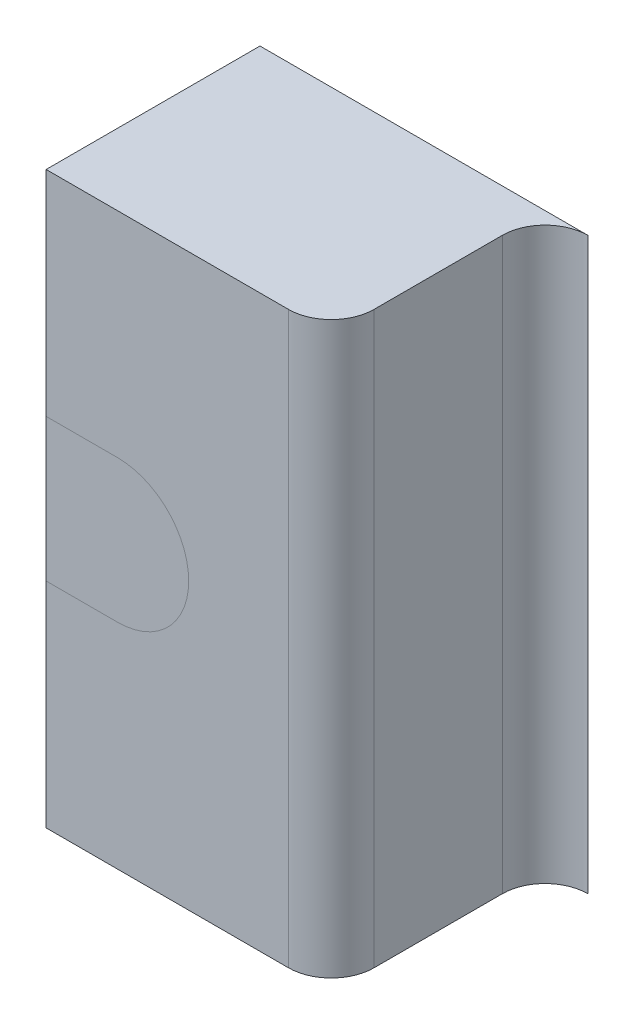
from build123d import *

# Parameters (mm, degrees)
SZKIC1_W                    = 50
SZKIC1_H                    = 50
DODANIE_WYCI_GNI_CIE1_DEPTH = 10
SZKIC2_W                    = 20
SZKIC2_H                    = 40
DODANIE_WYCI_GNI_CIE2_DEPTH = 15
ZAOKR_GLENIE1_R             = 3
SZKIC4_W                    = 10
SZKIC4_H                    = 50
WYTNIJ_WYCI_GNI_CIE1_DEPTH  = 89.028404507


with BuildPart() as part:
    # Szkic1 → Dodanie-wyci_gni_cie1 (new body)
    with BuildSketch(Plane.XY):
        with Locations((25, 25)):
            Rectangle(SZKIC1_W, SZKIC1_H)
    extrude(amount=DODANIE_WYCI_GNI_CIE1_DEPTH)

    # Szkic2 → Dodanie-wyci_gni_cie2 (add)
    with BuildSketch(Plane.XY.offset(10)):
        with Locations((-8, 28.38594493)):
            Rectangle(SZKIC2_W, SZKIC2_H)
    extrude(amount=DODANIE_WYCI_GNI_CIE2_DEPTH)

    # Zaokr_glenie1
    zaokr_glenie1_edges = [part.edges().sort_by_distance(p)[0] for p in [
        (2, 28.38594493, 10),
        (2, 28.38594493, 25),
    ]]
    fillet(zaokr_glenie1_edges, radius=ZAOKR_GLENIE1_R)

    # Szkic4 → Wytnij-wyci_gni_cie1 (cut, through all)
    with BuildSketch(Plane(origin=(50, 0, 0), x_dir=(0, 0, -1), z_dir=(1, 0, 0))):
        with Locations((-5, 25)):
            Rectangle(SZKIC4_W, SZKIC4_H)
    extrude(amount=-WYTNIJ_WYCI_GNI_CIE1_DEPTH, mode=Mode.SUBTRACT)


solid = part.part
